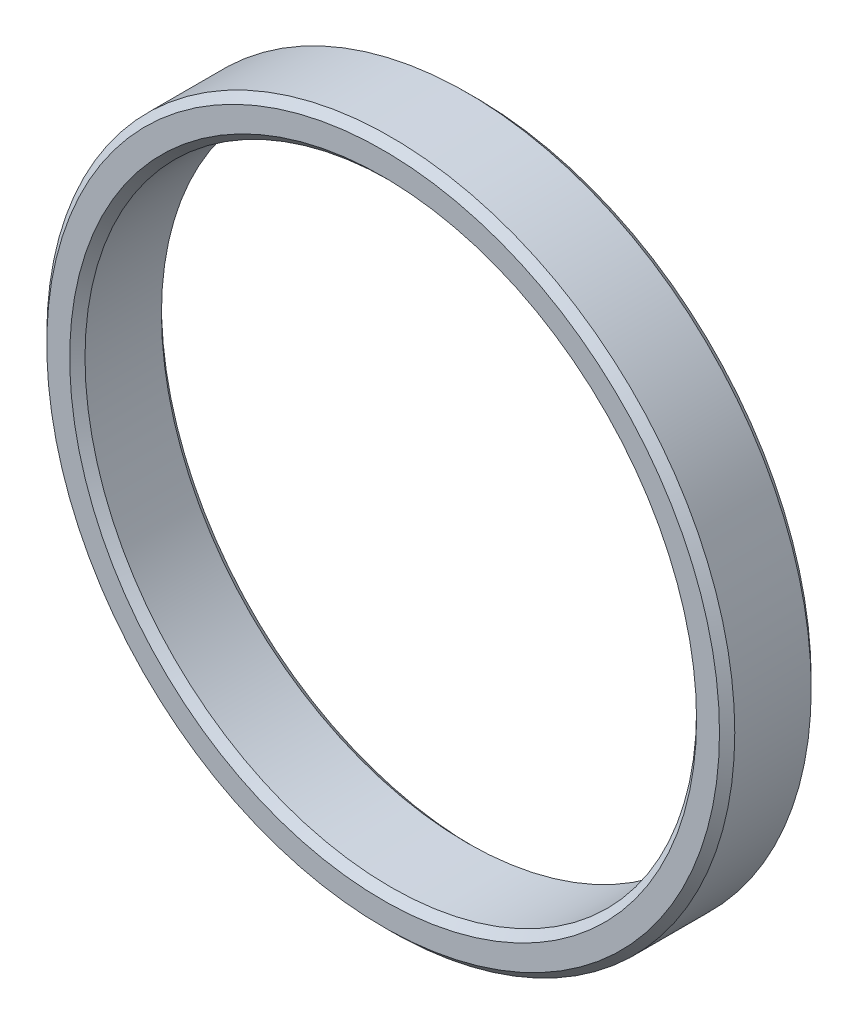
ISO-10303-21;
HEADER;
FILE_DESCRIPTION(('STEP AP214'),'2;1');
FILE_NAME('part.step','',(''),(''),'','','');
FILE_SCHEMA(('AUTOMOTIVE_DESIGN { 1 0 10303 214 1 1 1 1 }'));
ENDSEC;
DATA;
#1=APPLICATION_CONTEXT('core data for automotive mechanical design processes');
#2=APPLICATION_PROTOCOL_DEFINITION('international standard','automotive_design',2000,#1);
#3=PRODUCT_CONTEXT('',#1,'mechanical');
#4=PRODUCT('Part','Part','',(#3));
#5=PRODUCT_RELATED_PRODUCT_CATEGORY('part','',(#4));
#6=PRODUCT_DEFINITION_FORMATION('','',#4);
#7=PRODUCT_DEFINITION_CONTEXT('part definition',#1,'design');
#8=PRODUCT_DEFINITION('design','',#6,#7);
#9=PRODUCT_DEFINITION_SHAPE('','',#8);
#10=(LENGTH_UNIT() NAMED_UNIT(*) SI_UNIT(.MILLI.,.METRE.));
#11=(NAMED_UNIT(*) PLANE_ANGLE_UNIT() SI_UNIT($,.RADIAN.));
#12=(NAMED_UNIT(*) SI_UNIT($,.STERADIAN.) SOLID_ANGLE_UNIT());
#13=UNCERTAINTY_MEASURE_WITH_UNIT(LENGTH_MEASURE(1.E-05),#10,'distance_accuracy_value','');
#14=(GEOMETRIC_REPRESENTATION_CONTEXT(3) GLOBAL_UNCERTAINTY_ASSIGNED_CONTEXT((#13)) GLOBAL_UNIT_ASSIGNED_CONTEXT((#10,
#11,#12)) REPRESENTATION_CONTEXT('',''));
#15=CARTESIAN_POINT('',(0.,0.,0.));
#16=DIRECTION('',(0.,0.,1.));
#17=DIRECTION('',(1.,0.,0.));
#18=AXIS2_PLACEMENT_3D('',#15,#16,#17);
#19=CARTESIAN_POINT('',(0.,0.,6.));
#20=DIRECTION('',(0.,0.,1.));
#21=DIRECTION('',(1.,0.,0.));
#22=AXIS2_PLACEMENT_3D('',#19,#20,#21);
#23=PLANE('',#22);
#24=CARTESIAN_POINT('',(0.,0.,6.));
#25=DIRECTION('',(0.,0.,1.));
#26=DIRECTION('',(1.,0.,0.));
#27=AXIS2_PLACEMENT_3D('',#24,#25,#26);
#28=CIRCLE('',#27,22.);
#29=CARTESIAN_POINT('',(22.,0.,6.));
#30=VERTEX_POINT('',#29);
#31=EDGE_CURVE('E56',#30,#30,#28,.T.);
#32=ORIENTED_EDGE('',*,*,#31,.T.);
#33=EDGE_LOOP('',(#32));
#34=FACE_BOUND('',#33,.T.);
#35=CARTESIAN_POINT('',(0.,0.,6.));
#36=DIRECTION('',(0.,0.,1.));
#37=DIRECTION('',(1.,0.,0.));
#38=AXIS2_PLACEMENT_3D('',#35,#36,#37);
#39=CIRCLE('',#38,20.5);
#40=CARTESIAN_POINT('',(20.5,0.,6.));
#41=VERTEX_POINT('',#40);
#42=EDGE_CURVE('E59',#41,#41,#39,.F.);
#43=ORIENTED_EDGE('',*,*,#42,.T.);
#44=EDGE_LOOP('',(#43));
#45=FACE_BOUND('',#44,.T.);
#46=ADVANCED_FACE('F30',(#34,#45),#23,.T.);
#47=CARTESIAN_POINT('',(0.,0.,0.));
#48=DIRECTION('',(0.,0.,1.));
#49=DIRECTION('',(1.,0.,0.));
#50=AXIS2_PLACEMENT_3D('',#47,#48,#49);
#51=PLANE('',#50);
#52=CARTESIAN_POINT('',(0.,0.,0.));
#53=DIRECTION('',(0.,0.,1.));
#54=DIRECTION('',(1.,0.,0.));
#55=AXIS2_PLACEMENT_3D('',#52,#53,#54);
#56=CIRCLE('',#55,22.);
#57=CARTESIAN_POINT('',(22.,0.,0.));
#58=VERTEX_POINT('',#57);
#59=EDGE_CURVE('E10',#58,#58,#56,.F.);
#60=ORIENTED_EDGE('',*,*,#59,.T.);
#61=EDGE_LOOP('',(#60));
#62=FACE_BOUND('',#61,.T.);
#63=CARTESIAN_POINT('',(0.,0.,0.));
#64=DIRECTION('',(0.,0.,1.));
#65=DIRECTION('',(1.,0.,0.));
#66=AXIS2_PLACEMENT_3D('',#63,#64,#65);
#67=CIRCLE('',#66,20.5);
#68=CARTESIAN_POINT('',(20.5,0.,0.));
#69=VERTEX_POINT('',#68);
#70=EDGE_CURVE('E37',#69,#69,#67,.T.);
#71=ORIENTED_EDGE('',*,*,#70,.T.);
#72=EDGE_LOOP('',(#71));
#73=FACE_BOUND('',#72,.T.);
#74=ADVANCED_FACE('F88',(#62,#73),#51,.F.);
#75=CARTESIAN_POINT('',(0.,0.,6.));
#76=DIRECTION('',(0.,0.,-1.));
#77=DIRECTION('',(-1.,0.,0.));
#78=AXIS2_PLACEMENT_3D('',#75,#76,#77);
#79=CYLINDRICAL_SURFACE('',#78,22.5);
#80=CARTESIAN_POINT('',(0.,0.,5.5));
#81=DIRECTION('',(0.,0.,1.));
#82=DIRECTION('',(1.,0.,0.));
#83=AXIS2_PLACEMENT_3D('',#80,#81,#82);
#84=CIRCLE('',#83,22.5);
#85=CARTESIAN_POINT('',(22.5,0.,5.5));
#86=VERTEX_POINT('',#85);
#87=EDGE_CURVE('E50',#86,#86,#84,.F.);
#88=ORIENTED_EDGE('',*,*,#87,.T.);
#89=EDGE_LOOP('',(#88));
#90=FACE_BOUND('',#89,.T.);
#91=CARTESIAN_POINT('',(0.,0.,0.500000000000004));
#92=DIRECTION('',(0.,0.,1.));
#93=DIRECTION('',(1.,0.,0.));
#94=AXIS2_PLACEMENT_3D('',#91,#92,#93);
#95=CIRCLE('',#94,22.5);
#96=CARTESIAN_POINT('',(22.5,0.,0.500000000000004));
#97=VERTEX_POINT('',#96);
#98=EDGE_CURVE('E53',#97,#97,#95,.T.);
#99=ORIENTED_EDGE('',*,*,#98,.T.);
#100=EDGE_LOOP('',(#99));
#101=FACE_BOUND('',#100,.T.);
#102=ADVANCED_FACE('F32',(#90,#101),#79,.T.);
#103=CARTESIAN_POINT('',(0.,0.,6.));
#104=DIRECTION('',(0.,0.,-1.));
#105=DIRECTION('',(-1.,0.,0.));
#106=AXIS2_PLACEMENT_3D('',#103,#104,#105);
#107=CYLINDRICAL_SURFACE('',#106,20.);
#108=CARTESIAN_POINT('',(0.,0.,5.5));
#109=DIRECTION('',(0.,0.,1.));
#110=DIRECTION('',(1.,0.,0.));
#111=AXIS2_PLACEMENT_3D('',#108,#109,#110);
#112=CIRCLE('',#111,20.);
#113=CARTESIAN_POINT('',(20.,0.,5.5));
#114=VERTEX_POINT('',#113);
#115=EDGE_CURVE('E41',#114,#114,#112,.T.);
#116=ORIENTED_EDGE('',*,*,#115,.T.);
#117=EDGE_LOOP('',(#116));
#118=FACE_BOUND('',#117,.T.);
#119=CARTESIAN_POINT('',(0.,0.,0.500000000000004));
#120=DIRECTION('',(0.,0.,1.));
#121=DIRECTION('',(1.,0.,0.));
#122=AXIS2_PLACEMENT_3D('',#119,#120,#121);
#123=CIRCLE('',#122,20.);
#124=CARTESIAN_POINT('',(20.,0.,0.500000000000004));
#125=VERTEX_POINT('',#124);
#126=EDGE_CURVE('E45',#125,#125,#123,.F.);
#127=ORIENTED_EDGE('',*,*,#126,.T.);
#128=EDGE_LOOP('',(#127));
#129=FACE_BOUND('',#128,.T.);
#130=ADVANCED_FACE('F72',(#118,#129),#107,.F.);
#131=CARTESIAN_POINT('',(0.,0.,6.));
#132=DIRECTION('',(0.,0.,-1.));
#133=DIRECTION('',(-1.,0.,0.));
#134=AXIS2_PLACEMENT_3D('',#131,#132,#133);
#135=CONICAL_SURFACE('',#134,22.,0.785398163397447);
#136=ORIENTED_EDGE('',*,*,#87,.F.);
#137=EDGE_LOOP('',(#136));
#138=FACE_BOUND('',#137,.T.);
#139=ORIENTED_EDGE('',*,*,#31,.F.);
#140=EDGE_LOOP('',(#139));
#141=FACE_BOUND('',#140,.T.);
#142=ADVANCED_FACE('F68',(#138,#141),#135,.T.);
#143=CARTESIAN_POINT('',(0.,0.,5.5));
#144=DIRECTION('',(0.,0.,1.));
#145=DIRECTION('',(1.,0.,0.));
#146=AXIS2_PLACEMENT_3D('',#143,#144,#145);
#147=CONICAL_SURFACE('',#146,20.,0.785398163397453);
#148=ORIENTED_EDGE('',*,*,#42,.F.);
#149=EDGE_LOOP('',(#148));
#150=FACE_BOUND('',#149,.T.);
#151=ORIENTED_EDGE('',*,*,#115,.F.);
#152=EDGE_LOOP('',(#151));
#153=FACE_BOUND('',#152,.T.);
#154=ADVANCED_FACE('F64',(#150,#153),#147,.F.);
#155=CARTESIAN_POINT('',(0.,0.,0.500000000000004));
#156=DIRECTION('',(0.,0.,1.));
#157=DIRECTION('',(1.,0.,0.));
#158=AXIS2_PLACEMENT_3D('',#155,#156,#157);
#159=CONICAL_SURFACE('',#158,22.5,0.785398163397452);
#160=ORIENTED_EDGE('',*,*,#59,.F.);
#161=EDGE_LOOP('',(#160));
#162=FACE_BOUND('',#161,.T.);
#163=ORIENTED_EDGE('',*,*,#98,.F.);
#164=EDGE_LOOP('',(#163));
#165=FACE_BOUND('',#164,.T.);
#166=ADVANCED_FACE('F67',(#162,#165),#159,.T.);
#167=CARTESIAN_POINT('',(0.,0.,0.));
#168=DIRECTION('',(0.,0.,-1.));
#169=DIRECTION('',(-1.,0.,0.));
#170=AXIS2_PLACEMENT_3D('',#167,#168,#169);
#171=CONICAL_SURFACE('',#170,20.5,0.785398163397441);
#172=ORIENTED_EDGE('',*,*,#126,.F.);
#173=EDGE_LOOP('',(#172));
#174=FACE_BOUND('',#173,.T.);
#175=ORIENTED_EDGE('',*,*,#70,.F.);
#176=EDGE_LOOP('',(#175));
#177=FACE_BOUND('',#176,.T.);
#178=ADVANCED_FACE('F78',(#174,#177),#171,.F.);
#179=CLOSED_SHELL('',(#46,#74,#102,#130,#142,#154,#166,#178));
#180=MANIFOLD_SOLID_BREP('B2',#179);
#181=ADVANCED_BREP_SHAPE_REPRESENTATION('',(#18,#180),#14);
#182=SHAPE_DEFINITION_REPRESENTATION(#9,#181);
ENDSEC;
END-ISO-10303-21;
